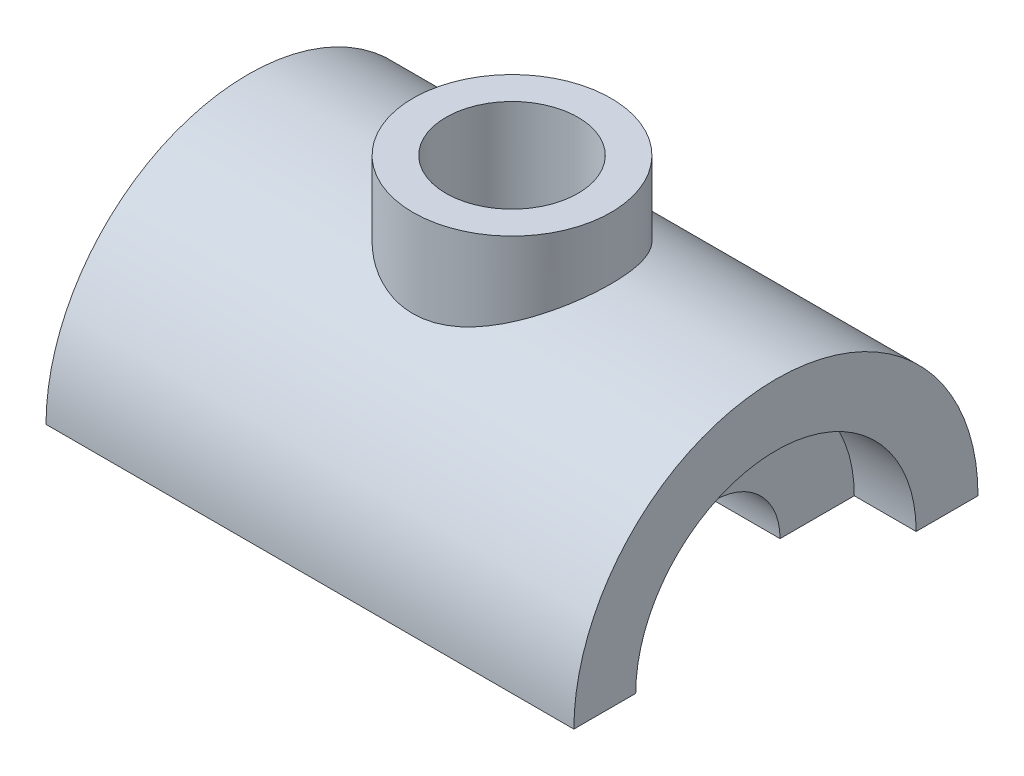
ISO-10303-21;
HEADER;
FILE_DESCRIPTION(('STEP AP214'),'2;1');
FILE_NAME('part.step','',(''),(''),'','','');
FILE_SCHEMA(('AUTOMOTIVE_DESIGN { 1 0 10303 214 1 1 1 1 }'));
ENDSEC;
DATA;
#1=APPLICATION_CONTEXT('core data for automotive mechanical design processes');
#2=APPLICATION_PROTOCOL_DEFINITION('international standard','automotive_design',2000,#1);
#3=PRODUCT_CONTEXT('',#1,'mechanical');
#4=PRODUCT('Part','Part','',(#3));
#5=PRODUCT_RELATED_PRODUCT_CATEGORY('part','',(#4));
#6=PRODUCT_DEFINITION_FORMATION('','',#4);
#7=PRODUCT_DEFINITION_CONTEXT('part definition',#1,'design');
#8=PRODUCT_DEFINITION('design','',#6,#7);
#9=PRODUCT_DEFINITION_SHAPE('','',#8);
#10=(LENGTH_UNIT() NAMED_UNIT(*) SI_UNIT(.MILLI.,.METRE.));
#11=(NAMED_UNIT(*) PLANE_ANGLE_UNIT() SI_UNIT($,.RADIAN.));
#12=(NAMED_UNIT(*) SI_UNIT($,.STERADIAN.) SOLID_ANGLE_UNIT());
#13=UNCERTAINTY_MEASURE_WITH_UNIT(LENGTH_MEASURE(1.E-05),#10,'distance_accuracy_value','');
#14=(GEOMETRIC_REPRESENTATION_CONTEXT(3) GLOBAL_UNCERTAINTY_ASSIGNED_CONTEXT((#13)) GLOBAL_UNIT_ASSIGNED_CONTEXT((#10,
#11,#12)) REPRESENTATION_CONTEXT('',''));
#15=CARTESIAN_POINT('',(0.,0.,0.));
#16=DIRECTION('',(0.,0.,1.));
#17=DIRECTION('',(1.,0.,0.));
#18=AXIS2_PLACEMENT_3D('',#15,#16,#17);
#19=CARTESIAN_POINT('',(-98.,0.,0.));
#20=DIRECTION('',(1.,0.,0.));
#21=DIRECTION('',(0.,0.,-1.));
#22=AXIS2_PLACEMENT_3D('',#19,#20,#21);
#23=CYLINDRICAL_SURFACE('',#22,32.);
#24=CARTESIAN_POINT('',(0.,0.,0.));
#25=DIRECTION('',(0.707106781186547,0.707106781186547,0.));
#26=DIRECTION('',(0.707106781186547,-0.707106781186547,0.));
#27=AXIS2_PLACEMENT_3D('',#24,#25,#26);
#28=ELLIPSE('',#27,45.254833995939,32.);
#29=CARTESIAN_POINT('',(0.,0.,32.));
#30=VERTEX_POINT('',#29);
#31=CARTESIAN_POINT('',(0.,0.,-32.));
#32=VERTEX_POINT('',#31);
#33=EDGE_CURVE('E47',#30,#32,#28,.F.);
#34=ORIENTED_EDGE('',*,*,#33,.F.);
#35=DIRECTION('',(1.,0.,0.));
#36=VECTOR('',#35,1.);
#37=CARTESIAN_POINT('',(-98.,0.,32.));
#38=LINE('',#37,#36);
#39=CARTESIAN_POINT('',(-98.,0.,32.));
#40=VERTEX_POINT('',#39);
#41=EDGE_CURVE('E113',#40,#30,#38,.T.);
#42=ORIENTED_EDGE('',*,*,#41,.F.);
#43=CARTESIAN_POINT('',(-98.,0.,0.));
#44=DIRECTION('',(-1.,0.,0.));
#45=DIRECTION('',(0.,0.,1.));
#46=AXIS2_PLACEMENT_3D('',#43,#44,#45);
#47=CIRCLE('',#46,32.);
#48=CARTESIAN_POINT('',(-98.,0.,-32.));
#49=VERTEX_POINT('',#48);
#50=EDGE_CURVE('E189',#40,#49,#47,.T.);
#51=ORIENTED_EDGE('',*,*,#50,.T.);
#52=DIRECTION('',(1.,0.,0.));
#53=VECTOR('',#52,1.);
#54=CARTESIAN_POINT('',(-98.,0.,-32.));
#55=LINE('',#54,#53);
#56=EDGE_CURVE('E115',#49,#32,#55,.T.);
#57=ORIENTED_EDGE('',*,*,#56,.T.);
#58=EDGE_LOOP('',(#34,#42,#51,#57));
#59=FACE_BOUND('',#58,.T.);
#60=ADVANCED_FACE('F31',(#59),#23,.F.);
#61=CARTESIAN_POINT('',(-128.,0.,0.));
#62=DIRECTION('',(1.,0.,0.));
#63=DIRECTION('',(0.,0.,-1.));
#64=AXIS2_PLACEMENT_3D('',#61,#62,#63);
#65=CYLINDRICAL_SURFACE('',#64,68.);
#66=DIRECTION('',(1.,0.,0.));
#67=VECTOR('',#66,1.);
#68=CARTESIAN_POINT('',(-128.,0.,68.));
#69=LINE('',#68,#67);
#70=CARTESIAN_POINT('',(98.,0.,68.));
#71=VERTEX_POINT('',#70);
#72=CARTESIAN_POINT('',(128.,0.,68.));
#73=VERTEX_POINT('',#72);
#74=EDGE_CURVE('E160',#71,#73,#69,.T.);
#75=ORIENTED_EDGE('',*,*,#74,.F.);
#76=CARTESIAN_POINT('',(98.,0.,0.));
#77=DIRECTION('',(-1.,0.,0.));
#78=DIRECTION('',(0.,0.,1.));
#79=AXIS2_PLACEMENT_3D('',#76,#77,#78);
#80=CIRCLE('',#79,68.);
#81=CARTESIAN_POINT('',(98.,0.,-68.));
#82=VERTEX_POINT('',#81);
#83=EDGE_CURVE('E55',#71,#82,#80,.T.);
#84=ORIENTED_EDGE('',*,*,#83,.T.);
#85=DIRECTION('',(1.,0.,0.));
#86=VECTOR('',#85,1.);
#87=CARTESIAN_POINT('',(-128.,0.,-68.));
#88=LINE('',#87,#86);
#89=CARTESIAN_POINT('',(128.,0.,-68.));
#90=VERTEX_POINT('',#89);
#91=EDGE_CURVE('E158',#82,#90,#88,.T.);
#92=ORIENTED_EDGE('',*,*,#91,.T.);
#93=CARTESIAN_POINT('',(128.,0.,0.));
#94=DIRECTION('',(-1.,0.,0.));
#95=DIRECTION('',(0.,0.,1.));
#96=AXIS2_PLACEMENT_3D('',#93,#94,#95);
#97=CIRCLE('',#96,68.);
#98=EDGE_CURVE('E140',#73,#90,#97,.T.);
#99=ORIENTED_EDGE('',*,*,#98,.F.);
#100=EDGE_LOOP('',(#75,#84,#92,#99));
#101=FACE_BOUND('',#100,.T.);
#102=ADVANCED_FACE('F206',(#101),#65,.F.);
#103=CARTESIAN_POINT('',(-128.,0.,0.));
#104=DIRECTION('',(1.,0.,0.));
#105=DIRECTION('',(0.,0.,-1.));
#106=AXIS2_PLACEMENT_3D('',#103,#104,#105);
#107=CYLINDRICAL_SURFACE('',#106,98.);
#108=CARTESIAN_POINT('',(0.,85.4400374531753,48.));
#109=CARTESIAN_POINT('',(0.627549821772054,85.4400381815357,47.9999993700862));
#110=CARTESIAN_POINT('',(1.25512149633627,85.4469575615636,47.9876887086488));
#111=CARTESIAN_POINT('',(2.50906294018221,85.4745714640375,47.9384855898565));
#112=CARTESIAN_POINT('',(3.13543254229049,85.4952677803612,47.9015899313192));
#113=CARTESIAN_POINT('',(4.38589383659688,85.5502535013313,47.803319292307));
#114=CARTESIAN_POINT('',(5.00998460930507,85.5845478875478,47.7419353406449));
#115=CARTESIAN_POINT('',(6.25444606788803,85.6664007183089,47.5949022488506));
#116=CARTESIAN_POINT('',(6.87481634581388,85.7139605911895,47.5092504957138));
#117=CARTESIAN_POINT('',(8.73078872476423,85.8761195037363,47.2159204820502));
#118=CARTESIAN_POINT('',(9.95922184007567,86.0101064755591,46.9720278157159));
#119=CARTESIAN_POINT('',(12.3872448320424,86.3249293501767,46.3908953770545));
#120=CARTESIAN_POINT('',(13.5868376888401,86.5057603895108,46.0536652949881));
#121=CARTESIAN_POINT('',(15.9438826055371,86.9072247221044,45.2914856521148));
#122=CARTESIAN_POINT('',(17.1015208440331,87.12764687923,44.8669997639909));
#123=CARTESIAN_POINT('',(19.3748330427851,87.6022143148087,43.9332007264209));
#124=CARTESIAN_POINT('',(20.4905060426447,87.8563603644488,43.4238856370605));
#125=CARTESIAN_POINT('',(22.6744654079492,88.3912346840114,42.3244976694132));
#126=CARTESIAN_POINT('',(23.7427566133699,88.6719602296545,41.7344330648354));
#127=CARTESIAN_POINT('',(25.8275429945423,89.2527839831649,40.477399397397));
#128=CARTESIAN_POINT('',(26.8440359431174,89.5528830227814,39.8104270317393));
#129=CARTESIAN_POINT('',(28.8992854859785,90.1894668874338,38.3476902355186));
#130=CARTESIAN_POINT('',(29.9334573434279,90.5269533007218,37.5459138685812));
#131=CARTESIAN_POINT('',(31.9319687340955,91.2072783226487,35.8616406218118));
#132=CARTESIAN_POINT('',(32.8963052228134,91.5501171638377,34.9791402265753));
#133=CARTESIAN_POINT('',(34.7508371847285,92.232732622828,33.1374078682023));
#134=CARTESIAN_POINT('',(35.6409985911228,92.5725077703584,32.1781410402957));
#135=CARTESIAN_POINT('',(37.3418388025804,93.2405556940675,30.1877586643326));
#136=CARTESIAN_POINT('',(38.1525154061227,93.5688281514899,29.1566411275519));
#137=CARTESIAN_POINT('',(39.7386688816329,94.2263649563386,26.9590472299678));
#138=CARTESIAN_POINT('',(40.5085455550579,94.5543402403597,25.7881307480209));
#139=CARTESIAN_POINT('',(41.9461570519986,95.179099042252,23.3771213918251));
#140=CARTESIAN_POINT('',(42.613886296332,95.4758808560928,22.137024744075));
#141=CARTESIAN_POINT('',(43.8403779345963,96.0295754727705,19.5961778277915));
#142=CARTESIAN_POINT('',(44.3991911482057,96.2865068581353,18.2954561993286));
#143=CARTESIAN_POINT('',(45.4018849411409,96.7529535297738,15.6422327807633));
#144=CARTESIAN_POINT('',(45.8457771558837,96.962473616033,14.2897362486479));
#145=CARTESIAN_POINT('',(46.5866208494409,97.3150280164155,11.6382673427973));
#146=CARTESIAN_POINT('',(46.8915743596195,97.4616420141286,10.3420046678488));
#147=CARTESIAN_POINT('',(47.3932074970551,97.7039801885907,7.7239829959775));
#148=CARTESIAN_POINT('',(47.5898916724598,97.7997065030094,6.40222507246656));
#149=CARTESIAN_POINT('',(47.8723440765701,97.9374602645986,3.74477183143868));
#150=CARTESIAN_POINT('',(47.9581662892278,97.9795138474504,2.40908361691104));
#151=CARTESIAN_POINT('',(48.0178955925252,98.008762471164,-0.265361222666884));
#152=CARTESIAN_POINT('',(47.9918091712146,97.9959606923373,-1.60411766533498));
#153=CARTESIAN_POINT('',(47.8349695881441,97.9192542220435,-4.16137430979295));
#154=CARTESIAN_POINT('',(47.7131541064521,97.859713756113,-5.38056645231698));
#155=CARTESIAN_POINT('',(47.3772825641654,97.6963936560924,-7.80309213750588));
#156=CARTESIAN_POINT('',(47.163232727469,97.5926170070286,-9.00642674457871));
#157=CARTESIAN_POINT('',(46.6451900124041,97.3433216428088,-11.3891566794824));
#158=CARTESIAN_POINT('',(46.3411942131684,97.1978015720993,-12.5685512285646));
#159=CARTESIAN_POINT('',(45.6463102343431,96.8684267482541,-14.8959536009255));
#160=CARTESIAN_POINT('',(45.2554189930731,96.684570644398,-16.043960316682));
#161=CARTESIAN_POINT('',(44.3842005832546,96.2798337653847,-18.3179211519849));
#162=CARTESIAN_POINT('',(43.9026844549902,96.0584652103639,-19.4433321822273));
#163=CARTESIAN_POINT('',(42.8580460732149,95.5855390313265,-21.6489497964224));
#164=CARTESIAN_POINT('',(42.2949238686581,95.3339814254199,-22.7291564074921));
#165=CARTESIAN_POINT('',(41.0911023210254,94.8060442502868,-24.8394323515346));
#166=CARTESIAN_POINT('',(40.4503823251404,94.5296580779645,-25.869488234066));
#167=CARTESIAN_POINT('',(39.0956203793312,93.9579185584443,-27.8746598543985));
#168=CARTESIAN_POINT('',(38.3815744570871,93.6625641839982,-28.8497726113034));
#169=CARTESIAN_POINT('',(36.8155337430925,93.0313058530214,-30.8277539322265));
#170=CARTESIAN_POINT('',(35.9568933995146,92.6941670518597,-31.8249686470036));
#171=CARTESIAN_POINT('',(34.1619182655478,92.0127568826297,-33.7444773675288));
#172=CARTESIAN_POINT('',(33.2255791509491,91.6684851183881,-34.6667671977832));
#173=CARTESIAN_POINT('',(31.7664188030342,91.153157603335,-35.9906466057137));
#174=CARTESIAN_POINT('',(31.2706838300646,90.9814834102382,-36.4221978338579));
#175=CARTESIAN_POINT('',(30.2616226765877,90.6396187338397,-37.264810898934));
#176=CARTESIAN_POINT('',(29.7482979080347,90.4694281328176,-37.6758743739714));
#177=CARTESIAN_POINT('',(28.7046906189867,90.1316567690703,-38.4769202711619));
#178=CARTESIAN_POINT('',(28.1744095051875,89.9640757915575,-38.8669044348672));
#179=CARTESIAN_POINT('',(27.0973411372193,89.6326012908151,-39.6253472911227));
#180=CARTESIAN_POINT('',(26.5505488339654,89.4687089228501,-39.9937992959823));
#181=CARTESIAN_POINT('',(24.8209713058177,88.9652603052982,-41.108054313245));
#182=CARTESIAN_POINT('',(23.610496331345,88.6341328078,-41.8152737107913));
#183=CARTESIAN_POINT('',(21.1255214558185,88.0047963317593,-43.1240500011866));
#184=CARTESIAN_POINT('',(19.8510270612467,87.7065845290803,-43.725615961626));
#185=CARTESIAN_POINT('',(17.8979363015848,87.2922160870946,-44.5439359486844));
#186=CARTESIAN_POINT('',(17.2401326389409,87.1596050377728,-44.8026667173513));
#187=CARTESIAN_POINT('',(15.911784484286,86.9066168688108,-45.291452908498));
#188=CARTESIAN_POINT('',(15.2412433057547,86.786236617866,-45.5215156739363));
#189=CARTESIAN_POINT('',(13.8885408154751,86.5589228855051,-45.9522820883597));
#190=CARTESIAN_POINT('',(13.206379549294,86.4519893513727,-46.152985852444));
#191=CARTESIAN_POINT('',(11.8318393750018,86.2527077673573,-46.5243446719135));
#192=CARTESIAN_POINT('',(11.1394600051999,86.1603603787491,-46.6949983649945));
#193=CARTESIAN_POINT('',(9.1580695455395,85.9200039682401,-47.1366147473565));
#194=CARTESIAN_POINT('',(7.85829922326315,85.7907272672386,-47.3708096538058));
#195=CARTESIAN_POINT('',(5.23963468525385,85.5905898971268,-47.7314727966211));
#196=CARTESIAN_POINT('',(3.92074152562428,85.5197260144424,-47.8579469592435));
#197=CARTESIAN_POINT('',(1.27581238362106,85.439345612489,-48.0013031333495));
#198=CARTESIAN_POINT('',(-0.050219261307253,85.4297953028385,-48.0182455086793));
#199=CARTESIAN_POINT('',(-2.69807975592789,85.4723789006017,-47.9424071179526));
#200=CARTESIAN_POINT('',(-4.01990885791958,85.5245090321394,-47.8496330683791));
#201=CARTESIAN_POINT('',(-6.5121347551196,85.6797723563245,-47.5709857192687));
#202=CARTESIAN_POINT('',(-7.68409892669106,85.7770956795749,-47.3956922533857));
#203=CARTESIAN_POINT('',(-10.0073632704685,86.016349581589,-46.9600821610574));
#204=CARTESIAN_POINT('',(-11.158665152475,86.1582764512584,-46.6997726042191));
#205=CARTESIAN_POINT('',(-13.4339142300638,86.4823762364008,-46.0968062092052));
#206=CARTESIAN_POINT('',(-14.5578550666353,86.6645584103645,-45.7541304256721));
#207=CARTESIAN_POINT('',(-16.7720999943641,87.0638678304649,-44.9896512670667));
#208=CARTESIAN_POINT('',(-17.862402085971,87.2809971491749,-44.567843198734));
#209=CARTESIAN_POINT('',(-20.0538250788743,87.7551074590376,-43.6271829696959));
#210=CARTESIAN_POINT('',(-21.1531035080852,88.0134694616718,-43.1047379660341));
#211=CARTESIAN_POINT('',(-23.3040610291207,88.5550426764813,-41.9808690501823));
#212=CARTESIAN_POINT('',(-24.3557393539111,88.8382542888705,-41.3794438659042));
#213=CARTESIAN_POINT('',(-26.4075734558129,89.4225488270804,-40.1011432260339));
#214=CARTESIAN_POINT('',(-27.4077078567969,89.7236390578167,-39.4242368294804));
#215=CARTESIAN_POINT('',(-29.3520928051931,90.3365591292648,-37.9987896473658));
#216=CARTESIAN_POINT('',(-30.2963399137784,90.6483896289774,-37.2502444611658));
#217=CARTESIAN_POINT('',(-32.2350622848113,91.3135997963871,-35.5909841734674));
#218=CARTESIAN_POINT('',(-33.2219570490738,91.6674729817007,-34.6715887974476));
#219=CARTESIAN_POINT('',(-35.1157673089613,92.3706876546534,-32.7521120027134));
#220=CARTESIAN_POINT('',(-36.0226768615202,92.7200288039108,-31.7520245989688));
#221=CARTESIAN_POINT('',(-37.7513926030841,93.4052336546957,-29.6758735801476));
#222=CARTESIAN_POINT('',(-38.5731720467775,93.7410931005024,-28.5997862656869));
#223=CARTESIAN_POINT('',(-40.1256604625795,94.3905263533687,-26.3774250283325));
#224=CARTESIAN_POINT('',(-40.8563705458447,94.7041004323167,-25.2311519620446));
#225=CARTESIAN_POINT('',(-42.2363231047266,95.3074664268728,-22.8480035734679));
#226=CARTESIAN_POINT('',(-42.8833517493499,95.5965608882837,-21.6096662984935));
#227=CARTESIAN_POINT('',(-44.0697627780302,96.134615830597,-19.0739406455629));
#228=CARTESIAN_POINT('',(-44.6091419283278,96.3835751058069,-17.7765504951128));
#229=CARTESIAN_POINT('',(-45.5738045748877,96.8338253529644,-15.1329642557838));
#230=CARTESIAN_POINT('',(-45.9991664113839,97.0351490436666,-13.7868024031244));
#231=CARTESIAN_POINT('',(-46.730810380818,97.3841107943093,-11.0557297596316));
#232=CARTESIAN_POINT('',(-47.0371059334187,97.5317549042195,-9.67082335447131));
#233=CARTESIAN_POINT('',(-47.5045004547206,97.7580679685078,-6.99952983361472));
#234=CARTESIAN_POINT('',(-47.6761286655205,97.8417217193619,-5.71539831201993));
#235=CARTESIAN_POINT('',(-47.9150164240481,97.9583472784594,-3.13519378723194));
#236=CARTESIAN_POINT('',(-47.9822824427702,97.9913222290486,-1.83912152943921));
#237=CARTESIAN_POINT('',(-48.0115860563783,98.0056746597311,0.754128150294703));
#238=CARTESIAN_POINT('',(-47.9736526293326,97.9870663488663,2.05130516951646));
#239=CARTESIAN_POINT('',(-47.7931068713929,97.8987989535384,4.63657751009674));
#240=CARTESIAN_POINT('',(-47.6504970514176,97.8291410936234,5.92467304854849));
#241=CARTESIAN_POINT('',(-47.2743927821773,97.6465212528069,8.40262983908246));
#242=CARTESIAN_POINT('',(-47.0470477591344,97.5364958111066,9.59364909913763));
#243=CARTESIAN_POINT('',(-46.5042046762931,97.2758159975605,11.9507972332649));
#244=CARTESIAN_POINT('',(-46.1887112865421,97.1251637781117,13.1169274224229));
#245=CARTESIAN_POINT('',(-45.4726208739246,96.7866713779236,15.4172658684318));
#246=CARTESIAN_POINT('',(-45.0720167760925,96.5988281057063,16.551471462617));
#247=CARTESIAN_POINT('',(-44.1892753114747,96.1901193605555,18.7815405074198));
#248=CARTESIAN_POINT('',(-43.7071341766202,95.9692523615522,19.8774021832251));
#249=CARTESIAN_POINT('',(-42.6423433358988,95.4889202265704,22.0722159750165));
#250=CARTESIAN_POINT('',(-42.056218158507,95.2281888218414,23.1692040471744));
#251=CARTESIAN_POINT('',(-40.8038003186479,94.6817442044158,25.3098361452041));
#252=CARTESIAN_POINT('',(-40.1375060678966,94.3960304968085,26.3534791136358));
#253=CARTESIAN_POINT('',(-38.7289057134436,93.8057519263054,28.383063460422));
#254=CARTESIAN_POINT('',(-37.986571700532,93.5011801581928,29.3689834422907));
#255=CARTESIAN_POINT('',(-36.4303494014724,92.8798224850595,31.278537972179));
#256=CARTESIAN_POINT('',(-35.616457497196,92.5630359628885,32.2021693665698));
#257=CARTESIAN_POINT('',(-33.8398085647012,91.8933741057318,34.0687971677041));
#258=CARTESIAN_POINT('',(-32.8702610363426,91.5399528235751,35.0051463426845));
#259=CARTESIAN_POINT('',(-30.8552883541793,90.8358834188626,36.793560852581));
#260=CARTESIAN_POINT('',(-29.8098577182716,90.4852354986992,37.6456200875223));
#261=CARTESIAN_POINT('',(-27.6473927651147,89.7960326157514,39.2612350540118));
#262=CARTESIAN_POINT('',(-26.5302980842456,89.4574882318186,40.0247146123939));
#263=CARTESIAN_POINT('',(-24.2309321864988,88.8027218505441,41.4571698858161));
#264=CARTESIAN_POINT('',(-23.0486633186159,88.4864990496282,42.12614900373));
#265=CARTESIAN_POINT('',(-20.5936252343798,87.8786010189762,43.3802940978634));
#266=CARTESIAN_POINT('',(-19.3193115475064,87.5877648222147,43.9628662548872));
#267=CARTESIAN_POINT('',(-17.367424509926,87.1849825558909,44.7533923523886));
#268=CARTESIAN_POINT('',(-16.7098887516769,87.0562722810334,45.0030647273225));
#269=CARTESIAN_POINT('',(-15.3824454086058,86.8112574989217,45.4739052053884));
#270=CARTESIAN_POINT('',(-14.7125394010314,86.6949514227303,45.6950769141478));
#271=CARTESIAN_POINT('',(-13.3634906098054,86.4762455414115,46.1076275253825));
#272=CARTESIAN_POINT('',(-12.6843790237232,86.3738076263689,46.2990882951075));
#273=CARTESIAN_POINT('',(-11.3165286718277,86.183555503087,46.6522776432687));
#274=CARTESIAN_POINT('',(-10.6277912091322,86.0957393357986,46.8140102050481));
#275=CARTESIAN_POINT('',(-9.24247458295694,85.9357329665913,47.1070871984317));
#276=CARTESIAN_POINT('',(-8.54589982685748,85.8635344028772,47.2384478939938));
#277=CARTESIAN_POINT('',(-7.14624230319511,85.7355428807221,47.4703514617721));
#278=CARTESIAN_POINT('',(-6.44316072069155,85.6797469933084,47.5708998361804));
#279=CARTESIAN_POINT('',(-5.26245952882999,85.6006339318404,47.7130557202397));
#280=CARTESIAN_POINT('',(-4.7861563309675,85.5726600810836,47.7631893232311));
#281=CARTESIAN_POINT('',(-3.8319832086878,85.5245997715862,47.8491930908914));
#282=CARTESIAN_POINT('',(-3.35411372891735,85.5045112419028,47.8850670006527));
#283=CARTESIAN_POINT('',(-2.39721348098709,85.4723227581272,47.9424981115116));
#284=CARTESIAN_POINT('',(-1.91818263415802,85.4602233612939,47.9640543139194));
#285=CARTESIAN_POINT('',(-0.959438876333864,85.4440794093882,47.9928073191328));
#286=CARTESIAN_POINT('',(-0.47972582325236,85.4400368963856,48.000000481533));
#287=CARTESIAN_POINT('',(0.,85.4400374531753,48.));
#288=B_SPLINE_CURVE_WITH_KNOTS('',3,(#108,#109,#110,#111,#112,#113,#114,#115,#116,#117,#118,
#119,#120,#121,#122,#123,#124,#125,#126,#127,#128,#129,#130,#131,#132,#133,#134,#135,#136,#137,
#138,#139,#140,#141,#142,#143,#144,#145,#146,#147,#148,#149,#150,#151,#152,#153,#154,#155,#156,
#157,#158,#159,#160,#161,#162,#163,#164,#165,#166,#167,#168,#169,#170,#171,#172,#173,#174,#175,
#176,#177,#178,#179,#180,#181,#182,#183,#184,#185,#186,#187,#188,#189,#190,#191,#192,#193,#194,
#195,#196,#197,#198,#199,#200,#201,#202,#203,#204,#205,#206,#207,#208,#209,#210,#211,#212,#213,
#214,#215,#216,#217,#218,#219,#220,#221,#222,#223,#224,#225,#226,#227,#228,#229,#230,#231,#232,
#233,#234,#235,#236,#237,#238,#239,#240,#241,#242,#243,#244,#245,#246,#247,#248,#249,#250,#251,
#252,#253,#254,#255,#256,#257,#258,#259,#260,#261,#262,#263,#264,#265,#266,#267,#268,#269,#270,
#271,#272,#273,#274,#275,#276,#277,#278,#279,#280,#281,#282,#283,#284,#285,#286,#287),
.UNSPECIFIED.,.T.,.F.,(4,2,2,2,2,2,2,2,2,2,2,2,2,2,2,2,2,2,2,2,2,2,2,2,2,2,2,2,2,2,2,2,2,2,2,2,
2,2,2,2,2,2,2,2,2,2,2,2,2,2,2,2,2,2,2,2,2,2,2,2,2,2,2,2,2,2,2,2,2,2,2,2,2,2,2,2,2,2,2,2,2,2,2,2,
2,2,2,2,2,4),(0.,1.88252741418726,3.76529999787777,5.648762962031,7.53242880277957,
11.3058556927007,15.0788909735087,18.8323721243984,22.5859391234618,26.3391218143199,
30.0924657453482,34.1423138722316,38.1923384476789,42.2442129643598,46.2961996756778,
50.6082965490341,54.9206288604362,59.2309442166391,63.5408229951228,67.5545009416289,
71.5680102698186,75.5795644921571,79.590886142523,83.2666691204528,86.9422040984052,
90.6178584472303,94.2936423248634,98.0215185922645,101.749392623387,105.478261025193,
109.207331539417,113.278344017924,117.34958321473,119.387069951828,121.424393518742,
123.461548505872,125.499332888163,129.815018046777,134.130332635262,136.28723903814,
138.443591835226,140.599936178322,142.756378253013,146.73131516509,150.706033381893,
154.678560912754,158.650845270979,162.213758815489,165.776376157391,169.339813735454,
172.903462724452,176.632350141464,180.361297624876,184.091779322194,187.82249032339,
192.001113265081,196.180046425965,200.360288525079,204.540479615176,208.815122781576,
213.089894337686,217.361721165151,221.633066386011,225.522709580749,229.412111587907,
233.300442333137,237.188679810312,240.8370508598,244.485228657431,248.133709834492,
251.782359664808,255.590704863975,259.399125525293,263.208949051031,267.018965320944,
271.194600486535,275.370537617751,279.550039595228,283.729391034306,288.016079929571,
290.160504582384,292.304657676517,294.442793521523,296.580642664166,298.717344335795,
300.853664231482,302.292661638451,303.73128086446,305.17000042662,306.609084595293),.UNSPECIFIED.);
#289=CARTESIAN_POINT('',(0.,85.4400374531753,48.));
#290=VERTEX_POINT('',#289);
#291=EDGE_CURVE('E319',#290,#290,#288,.T.);
#292=ORIENTED_EDGE('',*,*,#291,.F.);
#293=EDGE_LOOP('',(#292));
#294=FACE_BOUND('',#293,.T.);
#295=DIRECTION('',(1.,0.,0.));
#296=VECTOR('',#295,1.);
#297=CARTESIAN_POINT('',(-128.,0.,98.));
#298=LINE('',#297,#296);
#299=CARTESIAN_POINT('',(-128.,0.,98.));
#300=VERTEX_POINT('',#299);
#301=CARTESIAN_POINT('',(128.,0.,98.));
#302=VERTEX_POINT('',#301);
#303=EDGE_CURVE('E35',#300,#302,#298,.T.);
#304=ORIENTED_EDGE('',*,*,#303,.T.);
#305=CARTESIAN_POINT('',(128.,0.,0.));
#306=DIRECTION('',(-1.,0.,0.));
#307=DIRECTION('',(0.,0.,1.));
#308=AXIS2_PLACEMENT_3D('',#305,#306,#307);
#309=CIRCLE('',#308,98.);
#310=CARTESIAN_POINT('',(128.,0.,-98.));
#311=VERTEX_POINT('',#310);
#312=EDGE_CURVE('E134',#302,#311,#309,.T.);
#313=ORIENTED_EDGE('',*,*,#312,.T.);
#314=DIRECTION('',(1.,0.,0.));
#315=VECTOR('',#314,1.);
#316=CARTESIAN_POINT('',(-128.,0.,-98.));
#317=LINE('',#316,#315);
#318=CARTESIAN_POINT('',(-128.,0.,-98.));
#319=VERTEX_POINT('',#318);
#320=EDGE_CURVE('E11',#319,#311,#317,.T.);
#321=ORIENTED_EDGE('',*,*,#320,.F.);
#322=CARTESIAN_POINT('',(-128.,0.,0.));
#323=DIRECTION('',(-1.,0.,0.));
#324=DIRECTION('',(0.,0.,1.));
#325=AXIS2_PLACEMENT_3D('',#322,#323,#324);
#326=CIRCLE('',#325,98.);
#327=EDGE_CURVE('E146',#300,#319,#326,.T.);
#328=ORIENTED_EDGE('',*,*,#327,.F.);
#329=EDGE_LOOP('',(#304,#313,#321,#328));
#330=FACE_BOUND('',#329,.T.);
#331=ADVANCED_FACE('F33',(#294,#330),#107,.T.);
#332=CARTESIAN_POINT('',(-128.,0.,0.));
#333=DIRECTION('',(0.,-1.,0.));
#334=DIRECTION('',(0.,0.,-1.));
#335=AXIS2_PLACEMENT_3D('',#332,#333,#334);
#336=PLANE('',#335);
#337=ORIENTED_EDGE('',*,*,#320,.T.);
#338=DIRECTION('',(0.,0.,-1.));
#339=VECTOR('',#338,1.);
#340=CARTESIAN_POINT('',(128.,0.,0.));
#341=LINE('',#340,#339);
#342=EDGE_CURVE('E143',#90,#311,#341,.T.);
#343=ORIENTED_EDGE('',*,*,#342,.F.);
#344=ORIENTED_EDGE('',*,*,#91,.F.);
#345=DIRECTION('',(0.,0.,-1.));
#346=VECTOR('',#345,1.);
#347=CARTESIAN_POINT('',(98.,0.,0.));
#348=LINE('',#347,#346);
#349=CARTESIAN_POINT('',(98.,0.,-32.));
#350=VERTEX_POINT('',#349);
#351=EDGE_CURVE('E187',#350,#82,#348,.T.);
#352=ORIENTED_EDGE('',*,*,#351,.F.);
#353=EDGE_CURVE('E130',#32,#350,#55,.T.);
#354=ORIENTED_EDGE('',*,*,#353,.F.);
#355=ORIENTED_EDGE('',*,*,#56,.F.);
#356=DIRECTION('',(0.,0.,-1.));
#357=VECTOR('',#356,1.);
#358=CARTESIAN_POINT('',(-98.,0.,0.));
#359=LINE('',#358,#357);
#360=CARTESIAN_POINT('',(-98.,0.,-68.));
#361=VERTEX_POINT('',#360);
#362=EDGE_CURVE('E124',#49,#361,#359,.T.);
#363=ORIENTED_EDGE('',*,*,#362,.T.);
#364=CARTESIAN_POINT('',(-128.,0.,-68.));
#365=VERTEX_POINT('',#364);
#366=EDGE_CURVE('E40',#365,#361,#88,.T.);
#367=ORIENTED_EDGE('',*,*,#366,.F.);
#368=DIRECTION('',(0.,0.,-1.));
#369=VECTOR('',#368,1.);
#370=CARTESIAN_POINT('',(-128.,0.,0.));
#371=LINE('',#370,#369);
#372=EDGE_CURVE('E154',#365,#319,#371,.T.);
#373=ORIENTED_EDGE('',*,*,#372,.T.);
#374=EDGE_LOOP('',(#337,#343,#344,#352,#354,#355,#363,#367,#373));
#375=FACE_BOUND('',#374,.T.);
#376=ADVANCED_FACE('F174',(#375),#336,.T.);
#377=CARTESIAN_POINT('',(-98.,0.,0.));
#378=DIRECTION('',(-1.,0.,0.));
#379=DIRECTION('',(0.,0.,1.));
#380=AXIS2_PLACEMENT_3D('',#377,#378,#379);
#381=CIRCLE('',#380,68.);
#382=CARTESIAN_POINT('',(-98.,0.,68.));
#383=VERTEX_POINT('',#382);
#384=EDGE_CURVE('E184',#383,#361,#381,.T.);
#385=ORIENTED_EDGE('',*,*,#384,.F.);
#386=CARTESIAN_POINT('',(-128.,0.,68.));
#387=VERTEX_POINT('',#386);
#388=EDGE_CURVE('E159',#387,#383,#69,.T.);
#389=ORIENTED_EDGE('',*,*,#388,.F.);
#390=CARTESIAN_POINT('',(-128.,0.,0.));
#391=DIRECTION('',(-1.,0.,0.));
#392=DIRECTION('',(0.,0.,1.));
#393=AXIS2_PLACEMENT_3D('',#390,#391,#392);
#394=CIRCLE('',#393,68.);
#395=EDGE_CURVE('E151',#387,#365,#394,.T.);
#396=ORIENTED_EDGE('',*,*,#395,.T.);
#397=ORIENTED_EDGE('',*,*,#366,.T.);
#398=EDGE_LOOP('',(#385,#389,#396,#397));
#399=FACE_BOUND('',#398,.T.);
#400=ADVANCED_FACE('F183',(#399),#65,.F.);
#401=CARTESIAN_POINT('',(-128.,0.,0.));
#402=DIRECTION('',(0.,-1.,0.));
#403=DIRECTION('',(0.,0.,-1.));
#404=AXIS2_PLACEMENT_3D('',#401,#402,#403);
#405=PLANE('',#404);
#406=ORIENTED_EDGE('',*,*,#388,.T.);
#407=DIRECTION('',(0.,0.,-1.));
#408=VECTOR('',#407,1.);
#409=CARTESIAN_POINT('',(-98.,0.,0.));
#410=LINE('',#409,#408);
#411=EDGE_CURVE('E129',#383,#40,#410,.T.);
#412=ORIENTED_EDGE('',*,*,#411,.T.);
#413=ORIENTED_EDGE('',*,*,#41,.T.);
#414=CARTESIAN_POINT('',(98.,0.,32.));
#415=VERTEX_POINT('',#414);
#416=EDGE_CURVE('E119',#30,#415,#38,.T.);
#417=ORIENTED_EDGE('',*,*,#416,.T.);
#418=DIRECTION('',(0.,0.,-1.));
#419=VECTOR('',#418,1.);
#420=CARTESIAN_POINT('',(98.,0.,0.));
#421=LINE('',#420,#419);
#422=EDGE_CURVE('E322',#71,#415,#421,.T.);
#423=ORIENTED_EDGE('',*,*,#422,.F.);
#424=ORIENTED_EDGE('',*,*,#74,.T.);
#425=DIRECTION('',(0.,0.,-1.));
#426=VECTOR('',#425,1.);
#427=CARTESIAN_POINT('',(128.,0.,0.));
#428=LINE('',#427,#426);
#429=EDGE_CURVE('E137',#302,#73,#428,.T.);
#430=ORIENTED_EDGE('',*,*,#429,.F.);
#431=ORIENTED_EDGE('',*,*,#303,.F.);
#432=DIRECTION('',(0.,0.,-1.));
#433=VECTOR('',#432,1.);
#434=CARTESIAN_POINT('',(-128.,0.,0.));
#435=LINE('',#434,#433);
#436=EDGE_CURVE('E148',#300,#387,#435,.T.);
#437=ORIENTED_EDGE('',*,*,#436,.T.);
#438=EDGE_LOOP('',(#406,#412,#413,#417,#423,#424,#430,#431,#437));
#439=FACE_BOUND('',#438,.T.);
#440=ADVANCED_FACE('F128',(#439),#405,.T.);
#441=CARTESIAN_POINT('',(-128.,-121.588187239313,0.));
#442=DIRECTION('',(-1.,0.,0.));
#443=DIRECTION('',(0.,0.,1.));
#444=AXIS2_PLACEMENT_3D('',#441,#442,#443);
#445=PLANE('',#444);
#446=ORIENTED_EDGE('',*,*,#327,.T.);
#447=ORIENTED_EDGE('',*,*,#372,.F.);
#448=ORIENTED_EDGE('',*,*,#395,.F.);
#449=ORIENTED_EDGE('',*,*,#436,.F.);
#450=EDGE_LOOP('',(#446,#447,#448,#449));
#451=FACE_BOUND('',#450,.T.);
#452=ADVANCED_FACE('F180',(#451),#445,.T.);
#453=CARTESIAN_POINT('',(128.,-121.588187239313,0.));
#454=DIRECTION('',(-1.,0.,0.));
#455=DIRECTION('',(0.,0.,1.));
#456=AXIS2_PLACEMENT_3D('',#453,#454,#455);
#457=PLANE('',#456);
#458=ORIENTED_EDGE('',*,*,#312,.F.);
#459=ORIENTED_EDGE('',*,*,#429,.T.);
#460=ORIENTED_EDGE('',*,*,#98,.T.);
#461=ORIENTED_EDGE('',*,*,#342,.T.);
#462=EDGE_LOOP('',(#458,#459,#460,#461));
#463=FACE_BOUND('',#462,.T.);
#464=ADVANCED_FACE('F170',(#463),#457,.F.);
#465=CARTESIAN_POINT('',(0.,0.,0.));
#466=DIRECTION('',(0.707106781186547,-0.707106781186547,0.));
#467=DIRECTION('',(0.707106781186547,0.707106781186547,0.));
#468=AXIS2_PLACEMENT_3D('',#465,#466,#467);
#469=ELLIPSE('',#468,45.254833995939,32.);
#470=EDGE_CURVE('E101',#32,#30,#469,.T.);
#471=ORIENTED_EDGE('',*,*,#470,.F.);
#472=ORIENTED_EDGE('',*,*,#353,.T.);
#473=CARTESIAN_POINT('',(98.,0.,0.));
#474=DIRECTION('',(-1.,0.,0.));
#475=DIRECTION('',(0.,0.,1.));
#476=AXIS2_PLACEMENT_3D('',#473,#474,#475);
#477=CIRCLE('',#476,32.);
#478=EDGE_CURVE('E122',#415,#350,#477,.T.);
#479=ORIENTED_EDGE('',*,*,#478,.F.);
#480=ORIENTED_EDGE('',*,*,#416,.F.);
#481=EDGE_LOOP('',(#471,#472,#479,#480));
#482=FACE_BOUND('',#481,.T.);
#483=ADVANCED_FACE('F120',(#482),#23,.F.);
#484=CARTESIAN_POINT('',(-98.,-121.588187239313,0.));
#485=DIRECTION('',(-1.,0.,0.));
#486=DIRECTION('',(0.,0.,1.));
#487=AXIS2_PLACEMENT_3D('',#484,#485,#486);
#488=PLANE('',#487);
#489=ORIENTED_EDGE('',*,*,#384,.T.);
#490=ORIENTED_EDGE('',*,*,#362,.F.);
#491=ORIENTED_EDGE('',*,*,#50,.F.);
#492=ORIENTED_EDGE('',*,*,#411,.F.);
#493=EDGE_LOOP('',(#489,#490,#491,#492));
#494=FACE_BOUND('',#493,.T.);
#495=ADVANCED_FACE('F194',(#494),#488,.T.);
#496=CARTESIAN_POINT('',(98.,-121.588187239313,0.));
#497=DIRECTION('',(-1.,0.,0.));
#498=DIRECTION('',(0.,0.,1.));
#499=AXIS2_PLACEMENT_3D('',#496,#497,#498);
#500=PLANE('',#499);
#501=ORIENTED_EDGE('',*,*,#83,.F.);
#502=ORIENTED_EDGE('',*,*,#422,.T.);
#503=ORIENTED_EDGE('',*,*,#478,.T.);
#504=ORIENTED_EDGE('',*,*,#351,.T.);
#505=EDGE_LOOP('',(#501,#502,#503,#504));
#506=FACE_BOUND('',#505,.T.);
#507=ADVANCED_FACE('F196',(#506),#500,.F.);
#508=CARTESIAN_POINT('',(0.,128.,0.));
#509=DIRECTION('',(0.,1.,0.));
#510=DIRECTION('',(0.,0.,1.));
#511=AXIS2_PLACEMENT_3D('',#508,#509,#510);
#512=PLANE('',#511);
#513=CARTESIAN_POINT('',(0.,128.,0.));
#514=DIRECTION('',(0.,1.,0.));
#515=DIRECTION('',(0.,0.,1.));
#516=AXIS2_PLACEMENT_3D('',#513,#514,#515);
#517=CIRCLE('',#516,32.);
#518=CARTESIAN_POINT('',(0.,128.,32.));
#519=VERTEX_POINT('',#518);
#520=EDGE_CURVE('E107',#519,#519,#517,.T.);
#521=ORIENTED_EDGE('',*,*,#520,.F.);
#522=EDGE_LOOP('',(#521));
#523=FACE_BOUND('',#522,.T.);
#524=CARTESIAN_POINT('',(0.,128.,0.));
#525=DIRECTION('',(0.,1.,0.));
#526=DIRECTION('',(0.,0.,1.));
#527=AXIS2_PLACEMENT_3D('',#524,#525,#526);
#528=CIRCLE('',#527,48.);
#529=CARTESIAN_POINT('',(0.,128.,48.));
#530=VERTEX_POINT('',#529);
#531=EDGE_CURVE('E116',#530,#530,#528,.T.);
#532=ORIENTED_EDGE('',*,*,#531,.T.);
#533=EDGE_LOOP('',(#532));
#534=FACE_BOUND('',#533,.T.);
#535=ADVANCED_FACE('F202',(#523,#534),#512,.T.);
#536=CARTESIAN_POINT('',(0.,-0.001000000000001,0.));
#537=DIRECTION('',(0.,1.,0.));
#538=DIRECTION('',(0.,0.,1.));
#539=AXIS2_PLACEMENT_3D('',#536,#537,#538);
#540=CYLINDRICAL_SURFACE('',#539,48.);
#541=ORIENTED_EDGE('',*,*,#531,.F.);
#542=EDGE_LOOP('',(#541));
#543=FACE_BOUND('',#542,.T.);
#544=ORIENTED_EDGE('',*,*,#291,.T.);
#545=EDGE_LOOP('',(#544));
#546=FACE_BOUND('',#545,.T.);
#547=ADVANCED_FACE('F248',(#543,#546),#540,.T.);
#548=CARTESIAN_POINT('',(0.,0.,0.));
#549=DIRECTION('',(0.,1.,0.));
#550=DIRECTION('',(0.,0.,1.));
#551=AXIS2_PLACEMENT_3D('',#548,#549,#550);
#552=CYLINDRICAL_SURFACE('',#551,32.);
#553=ORIENTED_EDGE('',*,*,#33,.T.);
#554=ORIENTED_EDGE('',*,*,#470,.T.);
#555=EDGE_LOOP('',(#553,#554));
#556=FACE_BOUND('',#555,.T.);
#557=ORIENTED_EDGE('',*,*,#520,.T.);
#558=EDGE_LOOP('',(#557));
#559=FACE_BOUND('',#558,.T.);
#560=ADVANCED_FACE('F102',(#556,#559),#552,.F.);
#561=CLOSED_SHELL('',(#60,#102,#331,#376,#400,#440,#452,#464,#483,#495,#507,#535,#547,#560));
#562=MANIFOLD_SOLID_BREP('B2',#561);
#563=ADVANCED_BREP_SHAPE_REPRESENTATION('',(#18,#562),#14);
#564=SHAPE_DEFINITION_REPRESENTATION(#9,#563);
ENDSEC;
END-ISO-10303-21;
